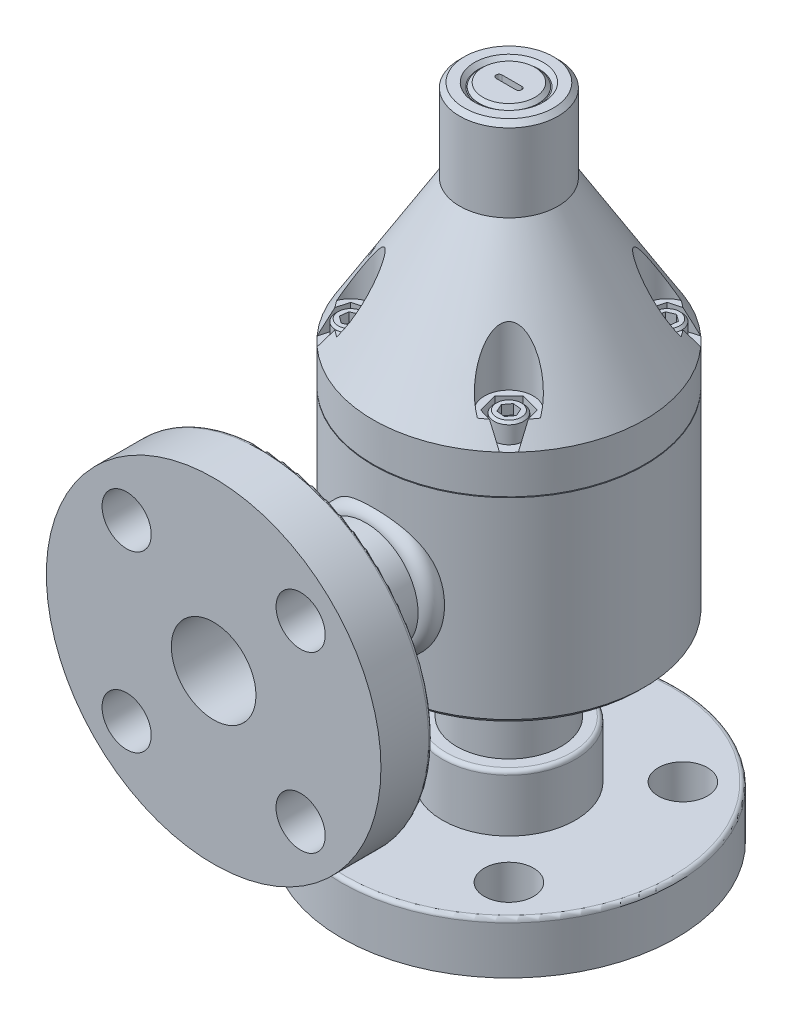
from build123d import *

# Parameters (mm, degrees)
SKETCH1_R                = 43.815
EXTRUDE1_DEPTH           = 148.59
CHAMFER1_SIZE            = 1.524
SKETCH3_R                = 11.1125
EXTRUDE2_DEPTH           = 1.27
EXTRUDE2_DRAFT           = -45
SKETCH4_R                = 9.525
EXTRUDE3_DEPTH           = 1.27
CHAMFER2_SIZE            = 1.143
EXTRUDE4_DEPTH           = 3.175
EXTRUDE4_DRAFT           = -1
SKETCH6_R                = 7.874
EXTRUDE5_DEPTH           = 22.86
EXTRUDE6_DEPTH           = 6.35
SKETCH8_R                = 4.7625
EXTRUDE7_DEPTH           = 6.35
EXTRUDE8_DEPTH           = 3.175
CIRPATTERN1_COUNT        = 4
CHAMFER3_SIZE            = 0.762
SKETCH10_R               = 53.975
BOSS_EXTRUDE1_DEPTH      = 16.6624
SKETCH11_R               = 21.4249
BOSS_EXTRUDE2_DEPTH      = 34.925
BOSS_EXTRUDE3_REACH      = 212.55
BOSS_EXTRUDE3_END_RADIUS = 43.815
SKETCH12_R               = 16.8275
SKETCH13_R               = 7.9375
CUT_EXTRUDE1_DEPTH       = 34.925
CIRPATTERN3_COUNT        = 4
SKETCH14_R               = 13.6525
CUT_EXTRUDE2_DEPTH       = 25.4
SKETCH20_R               = 53.975
BOSS_EXTRUDE7_DEPTH      = 16.6624
SKETCH21_R               = 21.463
BOSS_EXTRUDE8_DEPTH      = 34.925
SKETCH22_R               = 16.8275
BOSS_EXTRUDE9_DEPTH      = 63.5
FILLET2_R                = 1.27
SKETCH23_R               = 13.6525
CUT_EXTRUDE4_DEPTH       = 25.4
SKETCH24_R               = 7.9375
CUT_EXTRUDE5_DEPTH       = 25.4
CIRPATTERN5_COUNT        = 4
FILLET3_R                = 1.27


with BuildPart() as part:
    # Sketch1 → Extrude1 (new body)
    with BuildSketch(Plane(origin=(0, 0, 0), x_dir=(1, 0, 0), z_dir=(0, 1, 0))):
        with Locations(Location((0, 0, 0), (0, 0, 270))):
            Circle(SKETCH1_R)
    extrude(amount=EXTRUDE1_DEPTH)

    # Sketch2 → Cut-Revolve1 (revolve, cut)
    with BuildSketch(Plane.XY, mode=Mode.PRIVATE) as cut_revolve1_sk:
        Polygon((-52.628834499, 63.5), (-30.226, 63.5), (-30.226, 63.754), (-43.815, 63.754), (-43.815, 76.2), (-15.875, 121.92), (-15.875, 152.4), (-52.628834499, 152.4), align=None)
    revolve(cut_revolve1_sk.sketch.rotate(Axis((0, 148.59, 0), (0, -1, 0)), 270), axis=Axis((0, 148.59, 0), (0, -1, 0)), mode=Mode.SUBTRACT)

    # Chamfer1
    chamfer1_edges = [part.edges().sort_by_distance(p)[0] for p in [
        (0, 0, -43.815),
        (0, 148.59, -15.875),
    ]]
    chamfer(chamfer1_edges, length=CHAMFER1_SIZE)


with BuildPart() as extrude2_tool:
    # Sketch3 → Extrude2 (with draft: the straight prism first)
    with BuildSketch(Plane(origin=(0, 148.59, 0), x_dir=(-1, 0, 0), z_dir=(0, 1, 0))):
        Circle(SKETCH3_R)
    extrude(amount=-EXTRUDE2_DEPTH)
    # Extrude2: the draft: its side faces are tilted about the plane it starts from
    extrude2_sides = [extrude2_tool.faces().sort_by_distance(p)[0] for p in [
        (11.1125, 147.955, 0),
    ]]
    draft(extrude2_sides, Plane(origin=(0, 148.59, 0), x_dir=(-1, 0, 0), z_dir=(0, 1, 0)), EXTRUDE2_DRAFT)


with BuildPart() as part_1:
    add(part.part)

    # Extrude2: cut by extrude2_tool
    add(extrude2_tool.part, mode=Mode.SUBTRACT)

    # Sketch4 → Extrude3 (add)
    with BuildSketch(Plane(origin=(0, 148.59, 0), x_dir=(-1, 0, 0), z_dir=(0, 1, 0))):
        with Locations(Location((0, 0, 0), (0, 0, 90))):
            Circle(SKETCH4_R)
    extrude(amount=-EXTRUDE3_DEPTH)

    # Chamfer2
    chamfer2_edges = [part_1.edges().sort_by_distance(p)[0] for p in [
        (0, 148.59, -9.525),
    ]]
    chamfer(chamfer2_edges, length=CHAMFER2_SIZE)


with BuildPart() as extrude4_tool:
    # Sketch5 → Extrude4 (with draft: the straight prism first)
    with BuildSketch(Plane(origin=(0, 148.59, 0), x_dir=(-1, 0, 0), z_dir=(0, 1, 0))):
        with BuildLine():
            Line((3.175, 0.9652), (-3.175, 0.9652))
            ThreePointArc((-3.175, 0.9652), (-4.1402, 0), (-3.175, -0.9652))
            Line((-3.175, -0.9652), (3.175, -0.9652))
            ThreePointArc((3.175, -0.9652), (4.1402, 0), (3.175, 0.9652))
        make_face()
    extrude(amount=-EXTRUDE4_DEPTH)
    # Extrude4: the draft: its side faces are tilted about the plane it starts from
    extrude4_sides = [extrude4_tool.faces().sort_by_distance(p)[0] for p in [
        (0, 147.0025, 0.9652),
        (4.1402, 147.0025, 0),
        (0, 147.0025, -0.9652),
        (-4.1402, 147.0025, 0),
    ]]
    draft(extrude4_sides, Plane(origin=(0, 148.59, 0), x_dir=(-1, 0, 0), z_dir=(0, 1, 0)), EXTRUDE4_DRAFT)


with BuildPart() as part_2:
    add(part_1.part)

    # Extrude4: cut by extrude4_tool
    add(extrude4_tool.part, mode=Mode.SUBTRACT)

    # Sketch6 → Extrude5 (cut)
    with BuildSketch(Plane(origin=(0, 82.55, 0), x_dir=(-1, 0, 0), z_dir=(0, 1, 0))):
        with Locations((-25.521887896, 25.521887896)):
            Circle(SKETCH6_R)
    extrude5 = extrude(amount=EXTRUDE5_DEPTH, mode=Mode.SUBTRACT)

    # Sketch7 → Extrude6 (cut)
    with BuildSketch(Plane(origin=(0, 82.55, 0), x_dir=(-1, 0, 0), z_dir=(0, 1, 0))):
        Polygon((-30.08447079, 20.959305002), (-23.85186665, 19.289283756), (-19.289283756, 23.85186665), (-20.959305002, 30.08447079), (-33.653634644, 33.653634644), align=None)
    extrude6 = extrude(amount=-EXTRUDE6_DEPTH, mode=Mode.SUBTRACT)

    # Sketch8 → Extrude7 (add)
    with BuildSketch(Plane(origin=(0, 82.55, 0), x_dir=(-1, 0, 0), z_dir=(0, 1, 0))):
        with Locations(Location((-25.521887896, 25.521887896, 0), (0, 0, 90))):
            Circle(SKETCH8_R)
    extrude7 = extrude(amount=-EXTRUDE7_DEPTH)

    # Sketch9 → Extrude8 (cut)
    with BuildSketch(Plane(origin=(0, 82.55, 0), x_dir=(-1, 0, 0), z_dir=(0, 1, 0))):
        Polygon((-23.873856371, 27.745151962), (-26.623275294, 28.060757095), (-28.271306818, 25.83749303), (-27.169919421, 23.298623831), (-24.420500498, 22.983018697), (-22.772468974, 25.206282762), align=None)
    extrude8 = extrude(amount=-EXTRUDE8_DEPTH, mode=Mode.SUBTRACT)

    # CirPattern1: Extrude5, Extrude6, Extrude7, Extrude8 ×4 about axis
    cirpattern1_axis = Axis((0, 0, 0), (0, 1, 0))
    add([extrude5.rotate(cirpattern1_axis, i * 360 / CIRPATTERN1_COUNT) for i in range(1, CIRPATTERN1_COUNT)], mode=Mode.SUBTRACT)
    add([extrude6.rotate(cirpattern1_axis, i * 360 / CIRPATTERN1_COUNT) for i in range(1, CIRPATTERN1_COUNT)], mode=Mode.SUBTRACT)
    add([extrude7.rotate(cirpattern1_axis, i * 360 / CIRPATTERN1_COUNT) for i in range(1, CIRPATTERN1_COUNT)])
    add([extrude8.rotate(cirpattern1_axis, i * 360 / CIRPATTERN1_COUNT) for i in range(1, CIRPATTERN1_COUNT)], mode=Mode.SUBTRACT)

    # Chamfer3
    chamfer3_edges = [part_2.edges().sort_by_distance(p)[0] for p in [
        (-20.759387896, 82.55, 25.521887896),
        (-25.521887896, 82.55, -20.759387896),
        (20.759387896, 82.55, -25.521887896),
        (25.521887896, 82.55, 20.759387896),
    ]]
    chamfer(chamfer3_edges, length=CHAMFER3_SIZE)



with BuildPart() as body_2:
    # Sketch10 → Boss-Extrude1 (new body)
    with BuildSketch(Plane.XY.offset(95.25)):
        with Locations((0, 31.75)):
            Circle(SKETCH10_R)
    extrude(amount=-BOSS_EXTRUDE1_DEPTH)

    # Sketch11 → Boss-Extrude2 (add)
    with BuildSketch(Plane.XY.offset(95.25)):
        with Locations((0, 31.75)):
            Circle(SKETCH11_R)
    extrude(amount=-BOSS_EXTRUDE2_DEPTH)


with BuildPart() as part_3:
    add(part_2.part)

    add(body_2.part)  # Boss-Extrude3 merges body 2
    # Boss-Extrude3: up to this cylinder (the profile starts outside it)
    boss_extrude3_end = Plane(origin=(0, 31.75, 0), z_dir=(0, -1, 0)) * Cylinder(BOSS_EXTRUDE3_END_RADIUS, 513.73, mode=Mode.PRIVATE)
    # Sketch12 → Boss-Extrude3 (add, up to the surface)
    with BuildSketch(Plane.XY.offset(95.25), mode=Mode.PRIVATE) as boss_extrude3_sk1:
        with Locations((0, 31.75)):
            Circle(SKETCH12_R)
    boss_extrude3_tool1 = extrude(boss_extrude3_sk1.sketch, amount=-BOSS_EXTRUDE3_REACH, mode=Mode.PRIVATE) - boss_extrude3_end
    add(boss_extrude3_tool1.solids().sort_by_distance((0, 31.75, 95.25))[0])

    # Sketch13 → Cut-Extrude1 (cut)
    with BuildSketch(Plane.XY.offset(95.25)):
        with Locations((-28.063300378, 59.813300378)):
            Circle(SKETCH13_R)
    cut_extrude1 = extrude(amount=-CUT_EXTRUDE1_DEPTH, mode=Mode.SUBTRACT)

    # CirPattern3: Cut-Extrude1 ×4 about axis
    cirpattern3_axis = Axis((0, 31.75, 0), (0, 0, 1))
    for i in range(1, CIRPATTERN3_COUNT):
        add(cut_extrude1.rotate(cirpattern3_axis, i * 360 / CIRPATTERN3_COUNT), mode=Mode.SUBTRACT)

    # Sketch14 → Cut-Extrude2 (cut)
    with BuildSketch(Plane.XY.offset(95.25)):
        with Locations((0, 31.75)):
            Circle(SKETCH14_R)
    extrude(amount=-CUT_EXTRUDE2_DEPTH, mode=Mode.SUBTRACT)

    # Sketch19 → Revolve1 (revolve)
    with BuildSketch(Plane(origin=(0, 0, 0), x_dir=(0, 0, -1), z_dir=(1, 0, 0)), mode=Mode.PRIVATE) as revolve1_sk:
        with BuildLine():
            Line((-46.147022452, 46.327866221), (-46.147022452, 48.210883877))
            ThreePointArc((-46.147022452, 48.210883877), (-42.587276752, 51.938056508), (-38.700543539, 48.553250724))
            Line((-38.700543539, 48.553250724), (-38.700543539, 44.273665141))
            Line((-38.700543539, 44.273665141), (-46.147022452, 46.327866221))
        make_face()
    revolve(revolve1_sk.sketch.rotate(Axis((0, 31.843927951, 59.363719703), (0, 0, -1)), 229.501992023), axis=Axis((0, 31.843927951, 59.363719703), (0, 0, -1)))



with BuildPart() as body_2_2:
    # Sketch20 → Boss-Extrude7 (new body)
    with BuildSketch(Plane(origin=(0, -63.5, 0), x_dir=(1, 0, 0), z_dir=(0, 1, 0))):
        with Locations(Location((0, 0, 0), (0, 0, 270))):
            Circle(SKETCH20_R)
    extrude(amount=BOSS_EXTRUDE7_DEPTH)

    # Sketch21 → Boss-Extrude8 (add)
    with BuildSketch(Plane(origin=(0, -63.5, 0), x_dir=(1, 0, 0), z_dir=(0, 1, 0))):
        with Locations(Location((0, 0, 0), (0, 0, 270))):
            Circle(SKETCH21_R)
    extrude(amount=BOSS_EXTRUDE8_DEPTH)


with BuildPart() as part_4:
    add(part_3.part)

    add(body_2_2.part)  # Boss-Extrude9 merges body 2 2
    # Sketch22 → Boss-Extrude9 (add)
    with BuildSketch(Plane(origin=(0, -63.5, 0), x_dir=(1, 0, 0), z_dir=(0, 1, 0))):
        with Locations(Location((0, 0, 0), (0, 0, 270))):
            Circle(SKETCH22_R)
    extrude(amount=BOSS_EXTRUDE9_DEPTH)

    # Fillet2
    fillet2_edges = [part_4.edges().sort_by_distance(p)[0] for p in [
        (0, -28.575, -21.463),
        (0, -46.8376, -53.975),
    ]]
    fillet(fillet2_edges, radius=FILLET2_R)

    # Sketch23 → Cut-Extrude4 (cut)
    with BuildSketch(Plane(origin=(0, -63.5, 0), x_dir=(1, 0, 0), z_dir=(0, 1, 0))):
        with Locations(Location((0, 0, 0), (0, 0, 270))):
            Circle(SKETCH23_R)
    extrude(amount=CUT_EXTRUDE4_DEPTH, mode=Mode.SUBTRACT)

    # Sketch24 → Cut-Extrude5 (cut)
    with BuildSketch(Plane(origin=(0, -63.5, 0), x_dir=(1, 0, 0), z_dir=(0, 1, 0))):
        with Locations(Location((-28.063300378, -28.063300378, 0), (0, 0, 270))):
            Circle(SKETCH24_R)
    cut_extrude5 = extrude(amount=CUT_EXTRUDE5_DEPTH, mode=Mode.SUBTRACT)

    # CirPattern5: Cut-Extrude5 ×4 about axis
    cirpattern5_axis = Axis((0, 0, 0), (0, 1, 0))
    for i in range(1, CIRPATTERN5_COUNT):
        add(cut_extrude5.rotate(cirpattern5_axis, i * 360 / CIRPATTERN5_COUNT), mode=Mode.SUBTRACT)

    # Fillet3
    fillet3_edges = [part_4.edges().sort_by_distance(p)[0] for p in [
        (-53.975, 31.75, 78.5876),
        (-21.4249, 31.75, 60.325),
    ]]
    fillet(fillet3_edges, radius=FILLET3_R)

    # Sketch25 → Revolve2 (revolve)
    with BuildSketch(Plane(origin=(0, 0, 0), x_dir=(0, 0, -1), z_dir=(1, 0, 0)), mode=Mode.PRIVATE) as revolve2_sk:
        with BuildLine():
            Line((-20.0025, 0.351980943), (-20.0025, 2.606427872))
            Line((-20.0025, 2.606427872), (-16.084056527, 2.606427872))
            Line((-16.084056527, 2.606427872), (-16.084056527, -3.175))
            ThreePointArc((-16.084056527, -3.175), (-19.124392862, -2.61261793), (-20.0025, 0.351980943))
        make_face()
    revolve(revolve2_sk.sketch.rotate(Axis((0, 0, 0), (0, -1, 0)), 145.387559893), axis=Axis((0, 0, 0), (0, -1, 0)))


solid = part_4.part
